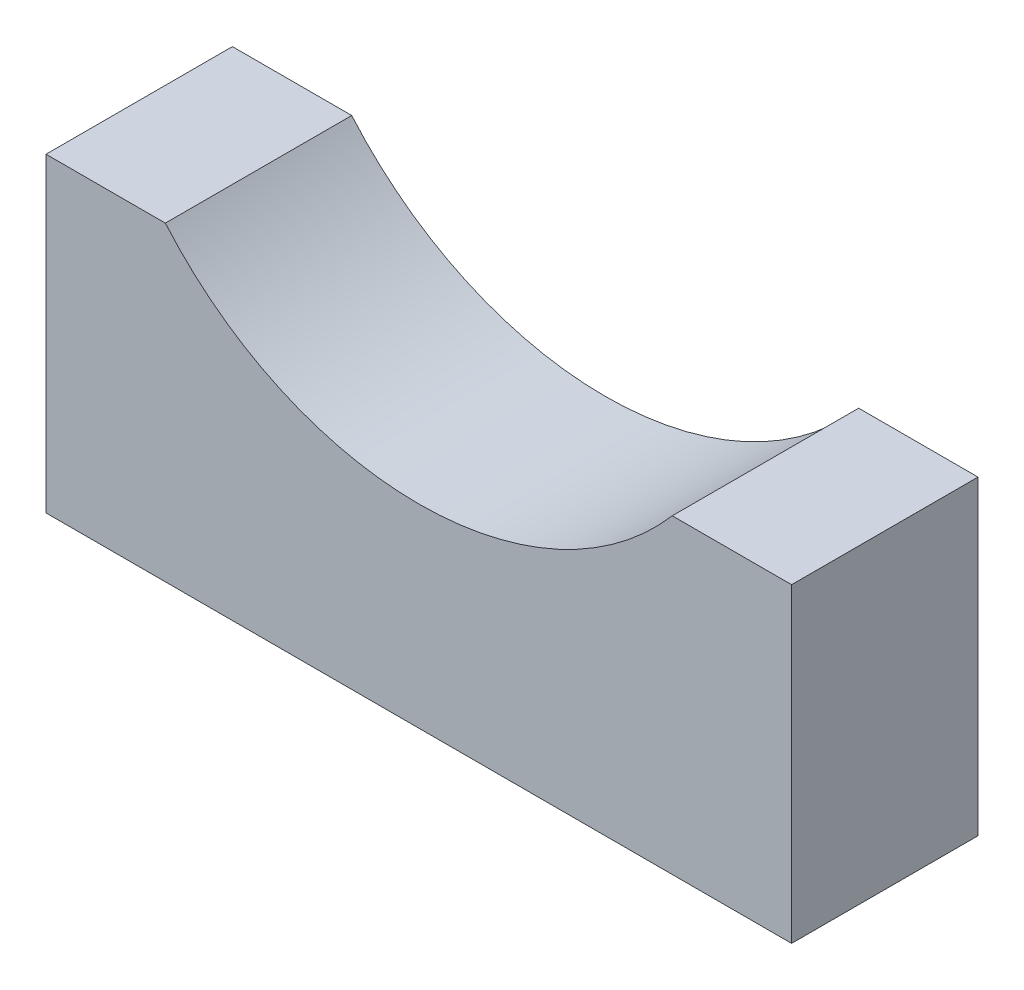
ISO-10303-21;
HEADER;
FILE_DESCRIPTION(('STEP AP214'),'2;1');
FILE_NAME('part.step','',(''),(''),'','','');
FILE_SCHEMA(('AUTOMOTIVE_DESIGN { 1 0 10303 214 1 1 1 1 }'));
ENDSEC;
DATA;
#1=APPLICATION_CONTEXT('core data for automotive mechanical design processes');
#2=APPLICATION_PROTOCOL_DEFINITION('international standard','automotive_design',2000,#1);
#3=PRODUCT_CONTEXT('',#1,'mechanical');
#4=PRODUCT('Part','Part','',(#3));
#5=PRODUCT_RELATED_PRODUCT_CATEGORY('part','',(#4));
#6=PRODUCT_DEFINITION_FORMATION('','',#4);
#7=PRODUCT_DEFINITION_CONTEXT('part definition',#1,'design');
#8=PRODUCT_DEFINITION('design','',#6,#7);
#9=PRODUCT_DEFINITION_SHAPE('','',#8);
#10=(LENGTH_UNIT() NAMED_UNIT(*) SI_UNIT(.MILLI.,.METRE.));
#11=(NAMED_UNIT(*) PLANE_ANGLE_UNIT() SI_UNIT($,.RADIAN.));
#12=(NAMED_UNIT(*) SI_UNIT($,.STERADIAN.) SOLID_ANGLE_UNIT());
#13=UNCERTAINTY_MEASURE_WITH_UNIT(LENGTH_MEASURE(1.E-05),#10,'distance_accuracy_value','');
#14=(GEOMETRIC_REPRESENTATION_CONTEXT(3) GLOBAL_UNCERTAINTY_ASSIGNED_CONTEXT((#13)) GLOBAL_UNIT_ASSIGNED_CONTEXT((#10,
#11,#12)) REPRESENTATION_CONTEXT('',''));
#15=CARTESIAN_POINT('',(0.,0.,0.));
#16=DIRECTION('',(0.,0.,1.));
#17=DIRECTION('',(1.,0.,0.));
#18=AXIS2_PLACEMENT_3D('',#15,#16,#17);
#19=CARTESIAN_POINT('',(-12.,5.,-6.));
#20=DIRECTION('',(0.,1.,0.));
#21=DIRECTION('',(0.,0.,1.));
#22=AXIS2_PLACEMENT_3D('',#19,#20,#21);
#23=PLANE('',#22);
#24=DIRECTION('',(0.,0.,1.));
#25=VECTOR('',#24,1.);
#26=CARTESIAN_POINT('',(-8.15858443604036,5.,-6.));
#27=LINE('',#26,#25);
#28=CARTESIAN_POINT('',(-8.15858443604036,5.,-6.));
#29=VERTEX_POINT('',#28);
#30=CARTESIAN_POINT('',(-8.15858443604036,5.,0.));
#31=VERTEX_POINT('',#30);
#32=EDGE_CURVE('E114',#29,#31,#27,.T.);
#33=ORIENTED_EDGE('',*,*,#32,.F.);
#34=DIRECTION('',(-1.,0.,0.));
#35=VECTOR('',#34,1.);
#36=CARTESIAN_POINT('',(-12.,5.,-6.));
#37=LINE('',#36,#35);
#38=CARTESIAN_POINT('',(-12.,5.,-6.));
#39=VERTEX_POINT('',#38);
#40=EDGE_CURVE('E211',#29,#39,#37,.T.);
#41=ORIENTED_EDGE('',*,*,#40,.T.);
#42=DIRECTION('',(0.,0.,1.));
#43=VECTOR('',#42,1.);
#44=CARTESIAN_POINT('',(-12.,5.,-6.));
#45=LINE('',#44,#43);
#46=CARTESIAN_POINT('',(-12.,5.,0.));
#47=VERTEX_POINT('',#46);
#48=EDGE_CURVE('E237',#39,#47,#45,.T.);
#49=ORIENTED_EDGE('',*,*,#48,.T.);
#50=DIRECTION('',(-1.,0.,0.));
#51=VECTOR('',#50,1.);
#52=CARTESIAN_POINT('',(-12.,5.,0.));
#53=LINE('',#52,#51);
#54=EDGE_CURVE('E225',#31,#47,#53,.T.);
#55=ORIENTED_EDGE('',*,*,#54,.F.);
#56=EDGE_LOOP('',(#33,#41,#49,#55));
#57=FACE_BOUND('',#56,.T.);
#58=ADVANCED_FACE('F94',(#57),#23,.T.);
#59=CARTESIAN_POINT('',(12.,-5.,-6.));
#60=DIRECTION('',(1.,0.,0.));
#61=DIRECTION('',(0.,0.,-1.));
#62=AXIS2_PLACEMENT_3D('',#59,#60,#61);
#63=PLANE('',#62);
#64=DIRECTION('',(0.,1.,0.));
#65=VECTOR('',#64,1.);
#66=CARTESIAN_POINT('',(12.,-5.,0.));
#67=LINE('',#66,#65);
#68=CARTESIAN_POINT('',(12.,-5.,0.));
#69=VERTEX_POINT('',#68);
#70=CARTESIAN_POINT('',(12.,5.,0.));
#71=VERTEX_POINT('',#70);
#72=EDGE_CURVE('E208',#69,#71,#67,.T.);
#73=ORIENTED_EDGE('',*,*,#72,.F.);
#74=DIRECTION('',(0.,0.,1.));
#75=VECTOR('',#74,1.);
#76=CARTESIAN_POINT('',(12.,-5.,-6.));
#77=LINE('',#76,#75);
#78=CARTESIAN_POINT('',(12.,-5.,-6.));
#79=VERTEX_POINT('',#78);
#80=EDGE_CURVE('E12',#79,#69,#77,.T.);
#81=ORIENTED_EDGE('',*,*,#80,.F.);
#82=DIRECTION('',(0.,1.,0.));
#83=VECTOR('',#82,1.);
#84=CARTESIAN_POINT('',(12.,-5.,-6.));
#85=LINE('',#84,#83);
#86=CARTESIAN_POINT('',(12.,5.,-6.));
#87=VERTEX_POINT('',#86);
#88=EDGE_CURVE('E209',#79,#87,#85,.T.);
#89=ORIENTED_EDGE('',*,*,#88,.T.);
#90=DIRECTION('',(0.,0.,1.));
#91=VECTOR('',#90,1.);
#92=CARTESIAN_POINT('',(12.,5.,-6.));
#93=LINE('',#92,#91);
#94=EDGE_CURVE('E98',#87,#71,#93,.T.);
#95=ORIENTED_EDGE('',*,*,#94,.T.);
#96=EDGE_LOOP('',(#73,#81,#89,#95));
#97=FACE_BOUND('',#96,.T.);
#98=ADVANCED_FACE('F96',(#97),#63,.T.);
#99=CARTESIAN_POINT('',(-12.,-5.,-6.));
#100=DIRECTION('',(0.,-1.,0.));
#101=DIRECTION('',(0.,0.,-1.));
#102=AXIS2_PLACEMENT_3D('',#99,#100,#101);
#103=PLANE('',#102);
#104=CARTESIAN_POINT('',(-10.25,-5.,-3.));
#105=DIRECTION('',(0.,-1.,0.));
#106=DIRECTION('',(0.,0.,-1.));
#107=AXIS2_PLACEMENT_3D('',#104,#105,#106);
#108=CIRCLE('',#107,1.02499999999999);
#109=CARTESIAN_POINT('',(-10.25,-5.,-4.02499999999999));
#110=VERTEX_POINT('',#109);
#111=EDGE_CURVE('E183',#110,#110,#108,.T.);
#112=ORIENTED_EDGE('',*,*,#111,.F.);
#113=EDGE_LOOP('',(#112));
#114=FACE_BOUND('',#113,.T.);
#115=CARTESIAN_POINT('',(10.25,-5.,-3.));
#116=DIRECTION('',(0.,-1.,0.));
#117=DIRECTION('',(0.,0.,-1.));
#118=AXIS2_PLACEMENT_3D('',#115,#116,#117);
#119=CIRCLE('',#118,1.02499999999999);
#120=CARTESIAN_POINT('',(10.25,-5.,-4.02499999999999));
#121=VERTEX_POINT('',#120);
#122=EDGE_CURVE('E182',#121,#121,#119,.T.);
#123=ORIENTED_EDGE('',*,*,#122,.F.);
#124=EDGE_LOOP('',(#123));
#125=FACE_BOUND('',#124,.T.);
#126=DIRECTION('',(1.,0.,0.));
#127=VECTOR('',#126,1.);
#128=CARTESIAN_POINT('',(-12.,-5.,0.));
#129=LINE('',#128,#127);
#130=CARTESIAN_POINT('',(-12.,-5.,0.));
#131=VERTEX_POINT('',#130);
#132=EDGE_CURVE('E212',#131,#69,#129,.T.);
#133=ORIENTED_EDGE('',*,*,#132,.F.);
#134=DIRECTION('',(0.,0.,1.));
#135=VECTOR('',#134,1.);
#136=CARTESIAN_POINT('',(-12.,-5.,-6.));
#137=LINE('',#136,#135);
#138=CARTESIAN_POINT('',(-12.,-5.,-6.));
#139=VERTEX_POINT('',#138);
#140=EDGE_CURVE('E103',#139,#131,#137,.T.);
#141=ORIENTED_EDGE('',*,*,#140,.F.);
#142=DIRECTION('',(1.,0.,0.));
#143=VECTOR('',#142,1.);
#144=CARTESIAN_POINT('',(-12.,-5.,-6.));
#145=LINE('',#144,#143);
#146=EDGE_CURVE('E220',#139,#79,#145,.T.);
#147=ORIENTED_EDGE('',*,*,#146,.T.);
#148=ORIENTED_EDGE('',*,*,#80,.T.);
#149=EDGE_LOOP('',(#133,#141,#147,#148));
#150=FACE_BOUND('',#149,.T.);
#151=ADVANCED_FACE('F250',(#114,#125,#150),#103,.T.);
#152=CARTESIAN_POINT('',(-12.,-5.,-6.));
#153=DIRECTION('',(-1.,0.,0.));
#154=DIRECTION('',(0.,0.,1.));
#155=AXIS2_PLACEMENT_3D('',#152,#153,#154);
#156=PLANE('',#155);
#157=DIRECTION('',(0.,-1.,0.));
#158=VECTOR('',#157,1.);
#159=CARTESIAN_POINT('',(-12.,-5.,0.));
#160=LINE('',#159,#158);
#161=EDGE_CURVE('E230',#47,#131,#160,.T.);
#162=ORIENTED_EDGE('',*,*,#161,.F.);
#163=ORIENTED_EDGE('',*,*,#48,.F.);
#164=DIRECTION('',(0.,-1.,0.));
#165=VECTOR('',#164,1.);
#166=CARTESIAN_POINT('',(-12.,-5.,-6.));
#167=LINE('',#166,#165);
#168=EDGE_CURVE('E216',#39,#139,#167,.T.);
#169=ORIENTED_EDGE('',*,*,#168,.T.);
#170=ORIENTED_EDGE('',*,*,#140,.T.);
#171=EDGE_LOOP('',(#162,#163,#169,#170));
#172=FACE_BOUND('',#171,.T.);
#173=ADVANCED_FACE('F254',(#172),#156,.T.);
#174=DIRECTION('',(0.,0.,1.));
#175=VECTOR('',#174,1.);
#176=CARTESIAN_POINT('',(8.15858443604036,5.,-6.));
#177=LINE('',#176,#175);
#178=CARTESIAN_POINT('',(8.15858443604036,5.,0.));
#179=VERTEX_POINT('',#178);
#180=CARTESIAN_POINT('',(8.15858443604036,5.,-6.));
#181=VERTEX_POINT('',#180);
#182=EDGE_CURVE('E202',#179,#181,#177,.F.);
#183=ORIENTED_EDGE('',*,*,#182,.F.);
#184=EDGE_CURVE('E226',#71,#179,#53,.T.);
#185=ORIENTED_EDGE('',*,*,#184,.F.);
#186=ORIENTED_EDGE('',*,*,#94,.F.);
#187=EDGE_CURVE('E213',#87,#181,#37,.T.);
#188=ORIENTED_EDGE('',*,*,#187,.T.);
#189=EDGE_LOOP('',(#183,#185,#186,#188));
#190=FACE_BOUND('',#189,.T.);
#191=ADVANCED_FACE('F247',(#190),#23,.T.);
#192=CARTESIAN_POINT('',(0.,0.,-6.));
#193=DIRECTION('',(0.,0.,-1.));
#194=DIRECTION('',(-1.,0.,0.));
#195=AXIS2_PLACEMENT_3D('',#192,#193,#194);
#196=PLANE('',#195);
#197=CARTESIAN_POINT('',(0.,12.,-6.));
#198=DIRECTION('',(0.,0.,1.));
#199=DIRECTION('',(1.,0.,0.));
#200=AXIS2_PLACEMENT_3D('',#197,#198,#199);
#201=CIRCLE('',#200,10.75);
#202=EDGE_CURVE('E198',#29,#181,#201,.T.);
#203=ORIENTED_EDGE('',*,*,#202,.T.);
#204=ORIENTED_EDGE('',*,*,#187,.F.);
#205=ORIENTED_EDGE('',*,*,#88,.F.);
#206=ORIENTED_EDGE('',*,*,#146,.F.);
#207=ORIENTED_EDGE('',*,*,#168,.F.);
#208=ORIENTED_EDGE('',*,*,#40,.F.);
#209=EDGE_LOOP('',(#203,#204,#205,#206,#207,#208));
#210=FACE_BOUND('',#209,.T.);
#211=ADVANCED_FACE('F257',(#210),#196,.T.);
#212=CARTESIAN_POINT('',(0.,0.,0.));
#213=DIRECTION('',(0.,0.,-1.));
#214=DIRECTION('',(-1.,0.,0.));
#215=AXIS2_PLACEMENT_3D('',#212,#213,#214);
#216=PLANE('',#215);
#217=ORIENTED_EDGE('',*,*,#184,.T.);
#218=CARTESIAN_POINT('',(0.,12.,0.));
#219=DIRECTION('',(0.,0.,1.));
#220=DIRECTION('',(1.,0.,0.));
#221=AXIS2_PLACEMENT_3D('',#218,#219,#220);
#222=CIRCLE('',#221,10.75);
#223=EDGE_CURVE('E197',#31,#179,#222,.T.);
#224=ORIENTED_EDGE('',*,*,#223,.F.);
#225=ORIENTED_EDGE('',*,*,#54,.T.);
#226=ORIENTED_EDGE('',*,*,#161,.T.);
#227=ORIENTED_EDGE('',*,*,#132,.T.);
#228=ORIENTED_EDGE('',*,*,#72,.T.);
#229=EDGE_LOOP('',(#217,#224,#225,#226,#227,#228));
#230=FACE_BOUND('',#229,.T.);
#231=ADVANCED_FACE('F249',(#230),#216,.F.);
#232=CARTESIAN_POINT('',(0.,12.,-6.));
#233=DIRECTION('',(0.,0.,1.));
#234=DIRECTION('',(1.,0.,0.));
#235=AXIS2_PLACEMENT_3D('',#232,#233,#234);
#236=CYLINDRICAL_SURFACE('',#235,10.75);
#237=ORIENTED_EDGE('',*,*,#32,.T.);
#238=ORIENTED_EDGE('',*,*,#223,.T.);
#239=ORIENTED_EDGE('',*,*,#182,.T.);
#240=ORIENTED_EDGE('',*,*,#202,.F.);
#241=EDGE_LOOP('',(#237,#238,#239,#240));
#242=FACE_BOUND('',#241,.T.);
#243=ADVANCED_FACE('F258',(#242),#236,.F.);
#244=CARTESIAN_POINT('',(10.25,0.,-3.));
#245=DIRECTION('',(0.,-1.,0.));
#246=DIRECTION('',(0.,0.,-1.));
#247=AXIS2_PLACEMENT_3D('',#244,#245,#246);
#248=CONICAL_SURFACE('',#247,1.025,1.02974425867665);
#249=CARTESIAN_POINT('',(10.25,0.615882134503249,-3.));
#250=VERTEX_POINT('',#249);
#251=VERTEX_LOOP('',#250);
#252=FACE_BOUND('',#251,.T.);
#253=CARTESIAN_POINT('',(10.25,0.,-3.));
#254=DIRECTION('',(0.,-1.,0.));
#255=DIRECTION('',(0.,0.,-1.));
#256=AXIS2_PLACEMENT_3D('',#253,#254,#255);
#257=CIRCLE('',#256,1.025);
#258=CARTESIAN_POINT('',(10.25,0.,-4.025));
#259=VERTEX_POINT('',#258);
#260=EDGE_CURVE('E188',#259,#259,#257,.T.);
#261=ORIENTED_EDGE('',*,*,#260,.T.);
#262=EDGE_LOOP('',(#261));
#263=FACE_BOUND('',#262,.T.);
#264=ADVANCED_FACE('F281',(#252,#263),#248,.F.);
#265=CARTESIAN_POINT('',(10.25,-5.,-3.));
#266=DIRECTION('',(0.,-1.,0.));
#267=DIRECTION('',(0.,0.,-1.));
#268=AXIS2_PLACEMENT_3D('',#265,#266,#267);
#269=CYLINDRICAL_SURFACE('',#268,1.02499999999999);
#270=ORIENTED_EDGE('',*,*,#260,.F.);
#271=EDGE_LOOP('',(#270));
#272=FACE_BOUND('',#271,.T.);
#273=ORIENTED_EDGE('',*,*,#122,.T.);
#274=EDGE_LOOP('',(#273));
#275=FACE_BOUND('',#274,.T.);
#276=ADVANCED_FACE('F175',(#272,#275),#269,.F.);
#277=CARTESIAN_POINT('',(-10.25,0.,-3.));
#278=DIRECTION('',(0.,-1.,0.));
#279=DIRECTION('',(0.,0.,-1.));
#280=AXIS2_PLACEMENT_3D('',#277,#278,#279);
#281=CONICAL_SURFACE('',#280,1.025,1.02974425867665);
#282=CARTESIAN_POINT('',(-10.25,0.615882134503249,-3.));
#283=VERTEX_POINT('',#282);
#284=VERTEX_LOOP('',#283);
#285=FACE_BOUND('',#284,.T.);
#286=CARTESIAN_POINT('',(-10.25,0.,-3.));
#287=DIRECTION('',(0.,-1.,0.));
#288=DIRECTION('',(0.,0.,-1.));
#289=AXIS2_PLACEMENT_3D('',#286,#287,#288);
#290=CIRCLE('',#289,1.025);
#291=CARTESIAN_POINT('',(-10.25,0.,-4.025));
#292=VERTEX_POINT('',#291);
#293=EDGE_CURVE('E179',#292,#292,#290,.T.);
#294=ORIENTED_EDGE('',*,*,#293,.T.);
#295=EDGE_LOOP('',(#294));
#296=FACE_BOUND('',#295,.T.);
#297=ADVANCED_FACE('F171',(#285,#296),#281,.F.);
#298=CARTESIAN_POINT('',(-10.25,-5.,-3.));
#299=DIRECTION('',(0.,-1.,0.));
#300=DIRECTION('',(0.,0.,-1.));
#301=AXIS2_PLACEMENT_3D('',#298,#299,#300);
#302=CYLINDRICAL_SURFACE('',#301,1.02499999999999);
#303=ORIENTED_EDGE('',*,*,#293,.F.);
#304=EDGE_LOOP('',(#303));
#305=FACE_BOUND('',#304,.T.);
#306=ORIENTED_EDGE('',*,*,#111,.T.);
#307=EDGE_LOOP('',(#306));
#308=FACE_BOUND('',#307,.T.);
#309=ADVANCED_FACE('F174',(#305,#308),#302,.F.);
#310=CLOSED_SHELL('',(#58,#98,#151,#173,#191,#211,#231,#243,#264,#276,#297,#309));
#311=MANIFOLD_SOLID_BREP('B2',#310);
#312=ADVANCED_BREP_SHAPE_REPRESENTATION('',(#18,#311),#14);
#313=SHAPE_DEFINITION_REPRESENTATION(#9,#312);
ENDSEC;
END-ISO-10303-21;
